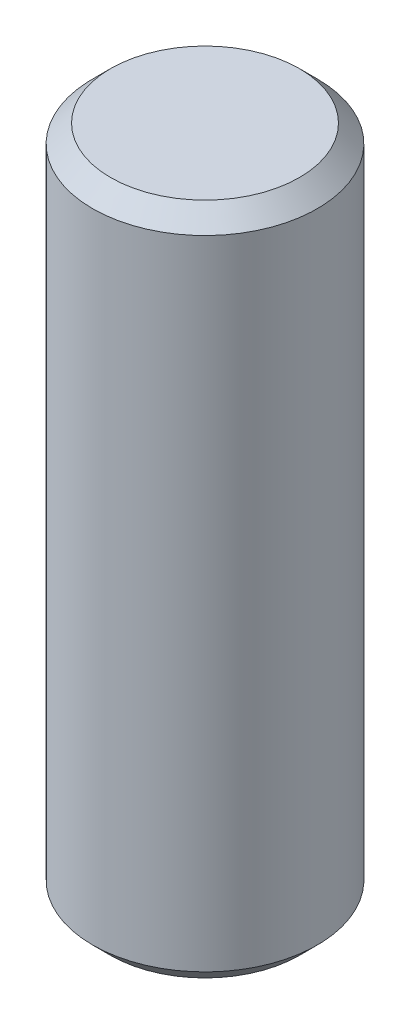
ISO-10303-21;
HEADER;
FILE_DESCRIPTION(('STEP AP214'),'2;1');
FILE_NAME('part.step','',(''),(''),'','','');
FILE_SCHEMA(('AUTOMOTIVE_DESIGN { 1 0 10303 214 1 1 1 1 }'));
ENDSEC;
DATA;
#1=APPLICATION_CONTEXT('core data for automotive mechanical design processes');
#2=APPLICATION_PROTOCOL_DEFINITION('international standard','automotive_design',2000,#1);
#3=PRODUCT_CONTEXT('',#1,'mechanical');
#4=PRODUCT('Part','Part','',(#3));
#5=PRODUCT_RELATED_PRODUCT_CATEGORY('part','',(#4));
#6=PRODUCT_DEFINITION_FORMATION('','',#4);
#7=PRODUCT_DEFINITION_CONTEXT('part definition',#1,'design');
#8=PRODUCT_DEFINITION('design','',#6,#7);
#9=PRODUCT_DEFINITION_SHAPE('','',#8);
#10=(LENGTH_UNIT() NAMED_UNIT(*) SI_UNIT(.MILLI.,.METRE.));
#11=(NAMED_UNIT(*) PLANE_ANGLE_UNIT() SI_UNIT($,.RADIAN.));
#12=(NAMED_UNIT(*) SI_UNIT($,.STERADIAN.) SOLID_ANGLE_UNIT());
#13=UNCERTAINTY_MEASURE_WITH_UNIT(LENGTH_MEASURE(1.E-05),#10,'distance_accuracy_value','');
#14=(GEOMETRIC_REPRESENTATION_CONTEXT(3) GLOBAL_UNCERTAINTY_ASSIGNED_CONTEXT((#13)) GLOBAL_UNIT_ASSIGNED_CONTEXT((#10,
#11,#12)) REPRESENTATION_CONTEXT('',''));
#15=CARTESIAN_POINT('',(0.,0.,0.));
#16=DIRECTION('',(0.,0.,1.));
#17=DIRECTION('',(1.,0.,0.));
#18=AXIS2_PLACEMENT_3D('',#15,#16,#17);
#19=CARTESIAN_POINT('',(0.,9.525,0.));
#20=DIRECTION('',(0.,-1.,0.));
#21=DIRECTION('',(0.,0.,-1.));
#22=AXIS2_PLACEMENT_3D('',#19,#20,#21);
#23=CYLINDRICAL_SURFACE('',#22,3.17754);
#24=CARTESIAN_POINT('',(0.,-9.01699999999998,0.));
#25=DIRECTION('',(0.,1.,0.));
#26=DIRECTION('',(0.,0.,1.));
#27=AXIS2_PLACEMENT_3D('',#24,#25,#26);
#28=CIRCLE('',#27,3.17754);
#29=CARTESIAN_POINT('',(0.,-9.01699999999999,-3.17754));
#30=VERTEX_POINT('',#29);
#31=EDGE_CURVE('E40',#30,#30,#28,.T.);
#32=CARTESIAN_POINT('',(0.,9.01700000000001,0.));
#33=DIRECTION('',(0.,1.,0.));
#34=DIRECTION('',(0.,0.,1.));
#35=AXIS2_PLACEMENT_3D('',#32,#33,#34);
#36=CIRCLE('',#35,3.17754);
#37=CARTESIAN_POINT('',(0.,9.01700000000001,-3.17754));
#38=VERTEX_POINT('',#37);
#39=EDGE_CURVE('E44',#38,#38,#36,.F.);
#40=CARTESIAN_POINT('',(0.,-9.01699999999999,-3.17754));
#41=CARTESIAN_POINT('',(0.,-8.82914583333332,-3.17754));
#42=CARTESIAN_POINT('',(0.,-8.64129166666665,-3.17754));
#43=CARTESIAN_POINT('',(0.,-8.26558333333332,-3.17754));
#44=CARTESIAN_POINT('',(0.,-8.07772916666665,-3.17754));
#45=CARTESIAN_POINT('',(0.,-7.70202083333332,-3.17754));
#46=CARTESIAN_POINT('',(0.,-7.51416666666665,-3.17754));
#47=CARTESIAN_POINT('',(0.,-7.13845833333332,-3.17754));
#48=CARTESIAN_POINT('',(0.,-6.95060416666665,-3.17754));
#49=CARTESIAN_POINT('',(0.,-6.57489583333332,-3.17754));
#50=CARTESIAN_POINT('',(0.,-6.38704166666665,-3.17754));
#51=CARTESIAN_POINT('',(0.,-6.01133333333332,-3.17754));
#52=CARTESIAN_POINT('',(0.,-5.82347916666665,-3.17754));
#53=CARTESIAN_POINT('',(0.,-5.44777083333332,-3.17754));
#54=CARTESIAN_POINT('',(0.,-5.25991666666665,-3.17754));
#55=CARTESIAN_POINT('',(0.,-4.88420833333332,-3.17754));
#56=CARTESIAN_POINT('',(0.,-4.69635416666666,-3.17754));
#57=CARTESIAN_POINT('',(0.,-4.32064583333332,-3.17754));
#58=CARTESIAN_POINT('',(0.,-4.13279166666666,-3.17754));
#59=CARTESIAN_POINT('',(0.,-3.75708333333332,-3.17754));
#60=CARTESIAN_POINT('',(0.,-3.56922916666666,-3.17754));
#61=CARTESIAN_POINT('',(0.,-3.19352083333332,-3.17754));
#62=CARTESIAN_POINT('',(0.,-3.00566666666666,-3.17754));
#63=CARTESIAN_POINT('',(0.,-2.62995833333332,-3.17754));
#64=CARTESIAN_POINT('',(0.,-2.44210416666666,-3.17754));
#65=CARTESIAN_POINT('',(0.,-2.06639583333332,-3.17754));
#66=CARTESIAN_POINT('',(0.,-1.87854166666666,-3.17754));
#67=CARTESIAN_POINT('',(0.,-1.50283333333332,-3.17754));
#68=CARTESIAN_POINT('',(0.,-1.31497916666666,-3.17754));
#69=CARTESIAN_POINT('',(0.,-0.939270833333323,-3.17754));
#70=CARTESIAN_POINT('',(0.,-0.751416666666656,-3.17754));
#71=CARTESIAN_POINT('',(0.,-0.375708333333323,-3.17754));
#72=CARTESIAN_POINT('',(0.,-0.187854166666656,-3.17754));
#73=CARTESIAN_POINT('',(0.,0.187854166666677,-3.17754));
#74=CARTESIAN_POINT('',(0.,0.375708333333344,-3.17754));
#75=CARTESIAN_POINT('',(0.,0.751416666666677,-3.17754));
#76=CARTESIAN_POINT('',(0.,0.939270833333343,-3.17754));
#77=CARTESIAN_POINT('',(0.,1.31497916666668,-3.17754));
#78=CARTESIAN_POINT('',(0.,1.50283333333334,-3.17754));
#79=CARTESIAN_POINT('',(0.,1.87854166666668,-3.17754));
#80=CARTESIAN_POINT('',(0.,2.06639583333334,-3.17754));
#81=CARTESIAN_POINT('',(0.,2.44210416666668,-3.17754));
#82=CARTESIAN_POINT('',(0.,2.62995833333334,-3.17754));
#83=CARTESIAN_POINT('',(0.,3.00566666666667,-3.17754));
#84=CARTESIAN_POINT('',(0.,3.19352083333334,-3.17754));
#85=CARTESIAN_POINT('',(0.,3.56922916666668,-3.17754));
#86=CARTESIAN_POINT('',(0.,3.75708333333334,-3.17754));
#87=CARTESIAN_POINT('',(0.,4.13279166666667,-3.17754));
#88=CARTESIAN_POINT('',(0.,4.32064583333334,-3.17754));
#89=CARTESIAN_POINT('',(0.,4.69635416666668,-3.17754));
#90=CARTESIAN_POINT('',(0.,4.88420833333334,-3.17754));
#91=CARTESIAN_POINT('',(0.,5.25991666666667,-3.17754));
#92=CARTESIAN_POINT('',(0.,5.44777083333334,-3.17754));
#93=CARTESIAN_POINT('',(0.,5.82347916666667,-3.17754));
#94=CARTESIAN_POINT('',(0.,6.01133333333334,-3.17754));
#95=CARTESIAN_POINT('',(0.,6.38704166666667,-3.17754));
#96=CARTESIAN_POINT('',(0.,6.57489583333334,-3.17754));
#97=CARTESIAN_POINT('',(0.,6.95060416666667,-3.17754));
#98=CARTESIAN_POINT('',(0.,7.13845833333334,-3.17754));
#99=CARTESIAN_POINT('',(0.,7.51416666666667,-3.17754));
#100=CARTESIAN_POINT('',(0.,7.70202083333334,-3.17754));
#101=CARTESIAN_POINT('',(0.,8.07772916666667,-3.17754));
#102=CARTESIAN_POINT('',(0.,8.26558333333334,-3.17754));
#103=CARTESIAN_POINT('',(0.,8.64129166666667,-3.17754));
#104=CARTESIAN_POINT('',(0.,8.82914583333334,-3.17754));
#105=CARTESIAN_POINT('',(0.,9.01700000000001,-3.17754));
#106=B_SPLINE_CURVE_WITH_KNOTS('',3,(#40,#41,#42,#43,#44,#45,#46,#47,#48,#49,#50,#51,#52,#53,
#54,#55,#56,#57,#58,#59,#60,#61,#62,#63,#64,#65,#66,#67,#68,#69,#70,#71,#72,#73,#74,#75,#76,#77,
#78,#79,#80,#81,#82,#83,#84,#85,#86,#87,#88,#89,#90,#91,#92,#93,#94,#95,#96,#97,#98,#99,#100,
#101,#102,#103,#104,#105),.UNSPECIFIED.,.F.,.F.,(4,2,2,2,2,2,2,2,2,2,2,2,2,2,2,2,2,2,2,2,2,2,2,
2,2,2,2,2,2,2,2,2,4),(0.,0.5635625,1.127125,1.6906875,2.25425,2.8178125,3.381375,3.9449375,
4.5085,5.0720625,5.635625,6.1991875,6.76275,7.3263125,7.889875,8.4534375,9.017,9.5805625,
10.144125,10.7076875,11.27125,11.8348125,12.398375,12.9619375,13.5255,14.0890625,14.652625,
15.2161875,15.77975,16.3433125,16.906875,17.4704375,18.034),.UNSPECIFIED.);
#107=EDGE_CURVE('BSEAM29',#30,#38,#106,.T.);
#108=ORIENTED_EDGE('',*,*,#31,.T.);
#109=ORIENTED_EDGE('',*,*,#39,.T.);
#110=ORIENTED_EDGE('',*,*,#107,.T.);
#111=ORIENTED_EDGE('',*,*,#107,.F.);
#112=EDGE_LOOP('',(#108,#110,#109,#111));
#113=FACE_BOUND('',#112,.T.);
#114=ADVANCED_FACE('F29',(#113),#23,.T.);
#115=CARTESIAN_POINT('',(0.,9.525,0.));
#116=DIRECTION('',(0.,1.,0.));
#117=DIRECTION('',(0.,0.,1.));
#118=AXIS2_PLACEMENT_3D('',#115,#116,#117);
#119=PLANE('',#118);
#120=CARTESIAN_POINT('',(0.,9.525,0.));
#121=DIRECTION('',(0.,1.,0.));
#122=DIRECTION('',(0.,0.,1.));
#123=AXIS2_PLACEMENT_3D('',#120,#121,#122);
#124=CIRCLE('',#123,2.66954000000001);
#125=CARTESIAN_POINT('',(0.,9.525,2.66954000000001));
#126=VERTEX_POINT('',#125);
#127=EDGE_CURVE('E10',#126,#126,#124,.T.);
#128=ORIENTED_EDGE('',*,*,#127,.T.);
#129=EDGE_LOOP('',(#128));
#130=FACE_BOUND('',#129,.T.);
#131=ADVANCED_FACE('F60',(#130),#119,.T.);
#132=CARTESIAN_POINT('',(0.,-9.525,0.));
#133=DIRECTION('',(0.,1.,0.));
#134=DIRECTION('',(0.,0.,1.));
#135=AXIS2_PLACEMENT_3D('',#132,#133,#134);
#136=PLANE('',#135);
#137=CARTESIAN_POINT('',(0.,-9.525,0.));
#138=DIRECTION('',(0.,1.,0.));
#139=DIRECTION('',(0.,0.,1.));
#140=AXIS2_PLACEMENT_3D('',#137,#138,#139);
#141=CIRCLE('',#140,2.66953999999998);
#142=CARTESIAN_POINT('',(0.,-9.525,2.66953999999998));
#143=VERTEX_POINT('',#142);
#144=EDGE_CURVE('E36',#143,#143,#141,.F.);
#145=ORIENTED_EDGE('',*,*,#144,.T.);
#146=EDGE_LOOP('',(#145));
#147=FACE_BOUND('',#146,.T.);
#148=ADVANCED_FACE('F57',(#147),#136,.F.);
#149=CARTESIAN_POINT('',(0.,-9.01699999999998,0.));
#150=DIRECTION('',(0.,1.,0.));
#151=DIRECTION('',(0.,0.,1.));
#152=AXIS2_PLACEMENT_3D('',#149,#150,#151);
#153=CONICAL_SURFACE('',#152,3.17754,0.785398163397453);
#154=ORIENTED_EDGE('',*,*,#144,.F.);
#155=EDGE_LOOP('',(#154));
#156=FACE_BOUND('',#155,.T.);
#157=ORIENTED_EDGE('',*,*,#31,.F.);
#158=EDGE_LOOP('',(#157));
#159=FACE_BOUND('',#158,.T.);
#160=ADVANCED_FACE('F53',(#156,#159),#153,.T.);
#161=CARTESIAN_POINT('',(0.,9.525,0.));
#162=DIRECTION('',(0.,-1.,0.));
#163=DIRECTION('',(0.,0.,-1.));
#164=AXIS2_PLACEMENT_3D('',#161,#162,#163);
#165=CONICAL_SURFACE('',#164,2.66954000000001,0.785398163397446);
#166=ORIENTED_EDGE('',*,*,#39,.F.);
#167=EDGE_LOOP('',(#166));
#168=FACE_BOUND('',#167,.T.);
#169=ORIENTED_EDGE('',*,*,#127,.F.);
#170=EDGE_LOOP('',(#169));
#171=FACE_BOUND('',#170,.T.);
#172=ADVANCED_FACE('F31',(#168,#171),#165,.T.);
#173=CLOSED_SHELL('',(#114,#131,#148,#160,#172));
#174=MANIFOLD_SOLID_BREP('B2',#173);
#175=ADVANCED_BREP_SHAPE_REPRESENTATION('',(#18,#174),#14);
#176=SHAPE_DEFINITION_REPRESENTATION(#9,#175);
ENDSEC;
END-ISO-10303-21;
